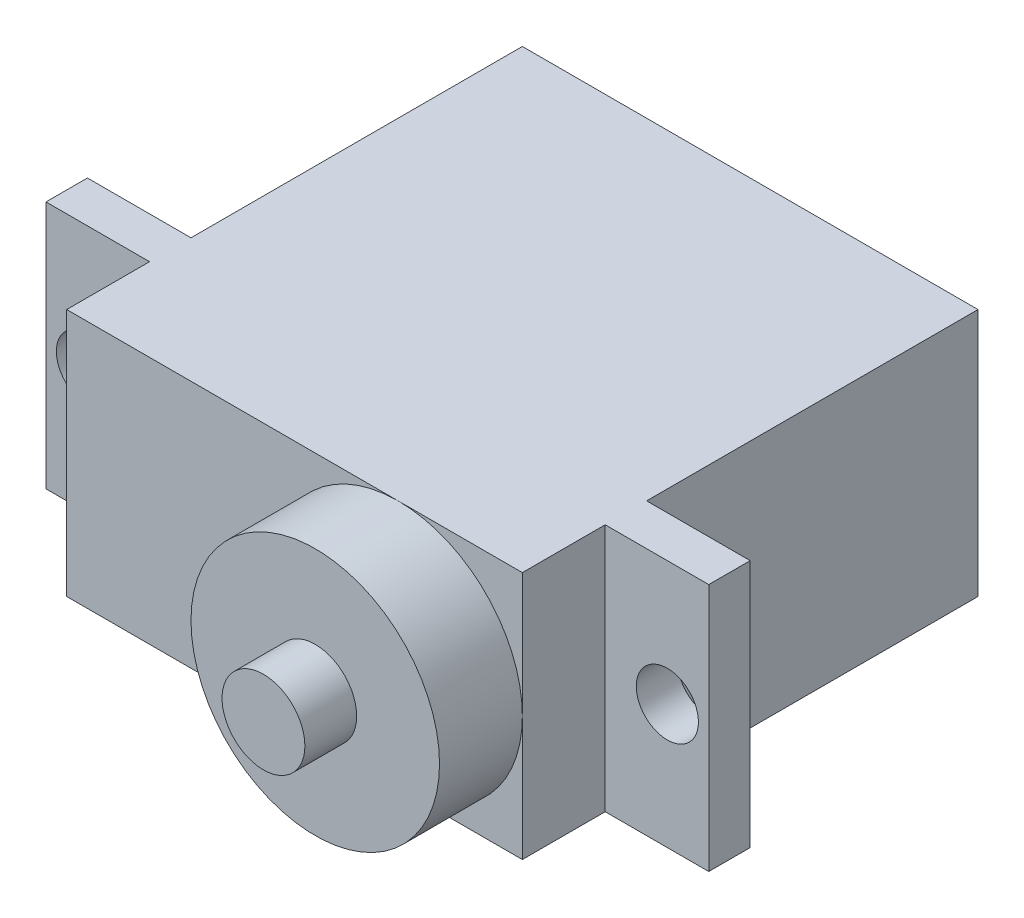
from build123d import *

# Parameters (mm, degrees)
ESQUISSE1_W             = 22
ESQUISSE1_H             = 12
BOSS_EXTRU_1_DEPTH      = 22
ESQUISSE2_W             = 2
ESQUISSE2_H             = 12
BOSS_EXTRU_2_DEPTH      = 5
ESQUISSE3_W             = 2
ESQUISSE3_H             = 12
BOSS_EXTRU_3_DEPTH      = 5
ESQUISSE4_R             = 6
BOSS_EXTRU_4_DEPTH      = 4
ESQUISSE5_R             = 2
BOSS_EXTRU_5_DEPTH      = 2.5
ENL_V_MAT_EXTRU_1_REACH = 32.248
ESQUISSE6_R             = 1.5
ENL_V_MAT_EXTRU_2_REACH = 32.248
ESQUISSE7_R             = 1.5


with BuildPart() as part:
    # Esquisse1 → Boss.-Extru.1 (new body)
    with BuildSketch(Plane.XY):
        with Locations((-6.839677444, 2.323809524)):
            Rectangle(ESQUISSE1_W, ESQUISSE1_H)
    extrude(amount=BOSS_EXTRU_1_DEPTH)

    # Esquisse2 → Boss.-Extru.2 (add)
    with BuildSketch(Plane(origin=(4.160322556, 0, 0), x_dir=(0, 0, -1), z_dir=(1, 0, 0))):
        with Locations((-17, 2.323809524)):
            Rectangle(ESQUISSE2_W, ESQUISSE2_H)
    extrude(amount=BOSS_EXTRU_2_DEPTH)

    # Esquisse3 → Boss.-Extru.3 (add)
    with BuildSketch(Plane.ZY.offset(17.839677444)):
        with Locations((17, 2.323809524)):
            Rectangle(ESQUISSE3_W, ESQUISSE3_H)
    extrude(amount=BOSS_EXTRU_3_DEPTH)

    # Esquisse4 → Boss.-Extru.4 (add)
    with BuildSketch(Plane.XY.offset(22)):
        with Locations((-1.839677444, 2.323809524)):
            Circle(ESQUISSE4_R)
    extrude(amount=BOSS_EXTRU_4_DEPTH)

    # Esquisse5 → Boss.-Extru.5 (add)
    with BuildSketch(Plane.XY.offset(26)):
        with Locations((-1.839677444, 2.323809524)):
            Circle(ESQUISSE5_R)
    extrude(amount=BOSS_EXTRU_5_DEPTH)

    # Esquisse6 → Enl_v. mat.-Extru.1 (cut, up to next)
    with BuildSketch(Plane.XY.offset(18), mode=Mode.PRIVATE) as enl_v_mat_extru_1_sk1:
        with Locations((7.160322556, 2.323809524)):
            Circle(ESQUISSE6_R)
    enl_v_mat_extru_1_tool1 = extrude(enl_v_mat_extru_1_sk1.sketch, amount=-ENL_V_MAT_EXTRU_1_REACH, mode=Mode.PRIVATE) & part.part
    add(enl_v_mat_extru_1_tool1.solids().sort_by_distance((7.160323, 2.32381, 18))[0], mode=Mode.SUBTRACT)

    # Esquisse7 → Enl_v. mat.-Extru.2 (cut, up to next)
    with BuildSketch(Plane.XY.offset(18), mode=Mode.PRIVATE) as enl_v_mat_extru_2_sk1:
        with Locations((-20.839677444, 2.323809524)):
            Circle(ESQUISSE7_R)
    enl_v_mat_extru_2_tool1 = extrude(enl_v_mat_extru_2_sk1.sketch, amount=-ENL_V_MAT_EXTRU_2_REACH, mode=Mode.PRIVATE) & part.part
    add(enl_v_mat_extru_2_tool1.solids().sort_by_distance((-20.839677, 2.32381, 18))[0], mode=Mode.SUBTRACT)


solid = part.part
